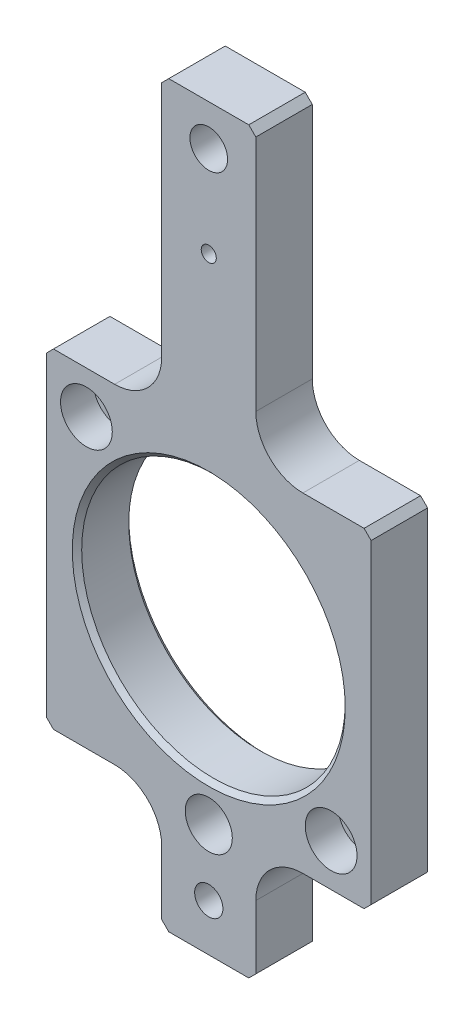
ISO-10303-21;
HEADER;
FILE_DESCRIPTION(('STEP AP214'),'2;1');
FILE_NAME('part.step','',(''),(''),'','','');
FILE_SCHEMA(('AUTOMOTIVE_DESIGN { 1 0 10303 214 1 1 1 1 }'));
ENDSEC;
DATA;
#1=APPLICATION_CONTEXT('core data for automotive mechanical design processes');
#2=APPLICATION_PROTOCOL_DEFINITION('international standard','automotive_design',2000,#1);
#3=PRODUCT_CONTEXT('',#1,'mechanical');
#4=PRODUCT('Part','Part','',(#3));
#5=PRODUCT_RELATED_PRODUCT_CATEGORY('part','',(#4));
#6=PRODUCT_DEFINITION_FORMATION('','',#4);
#7=PRODUCT_DEFINITION_CONTEXT('part definition',#1,'design');
#8=PRODUCT_DEFINITION('design','',#6,#7);
#9=PRODUCT_DEFINITION_SHAPE('','',#8);
#10=(LENGTH_UNIT() NAMED_UNIT(*) SI_UNIT(.MILLI.,.METRE.));
#11=(NAMED_UNIT(*) PLANE_ANGLE_UNIT() SI_UNIT($,.RADIAN.));
#12=(NAMED_UNIT(*) SI_UNIT($,.STERADIAN.) SOLID_ANGLE_UNIT());
#13=UNCERTAINTY_MEASURE_WITH_UNIT(LENGTH_MEASURE(1.E-05),#10,'distance_accuracy_value','');
#14=(GEOMETRIC_REPRESENTATION_CONTEXT(3) GLOBAL_UNCERTAINTY_ASSIGNED_CONTEXT((#13)) GLOBAL_UNIT_ASSIGNED_CONTEXT((#10,
#11,#12)) REPRESENTATION_CONTEXT('',''));
#15=CARTESIAN_POINT('',(0.,0.,0.));
#16=DIRECTION('',(0.,0.,1.));
#17=DIRECTION('',(1.,0.,0.));
#18=AXIS2_PLACEMENT_3D('',#15,#16,#17);
#19=CARTESIAN_POINT('',(36.,34.,0.));
#20=DIRECTION('',(0.,0.,1.));
#21=DIRECTION('',(1.,0.,0.));
#22=AXIS2_PLACEMENT_3D('',#19,#20,#21);
#23=CYLINDRICAL_SURFACE('',#22,3.2);
#24=CARTESIAN_POINT('',(36.,34.,0.));
#25=DIRECTION('',(0.,0.,1.));
#26=DIRECTION('',(1.,0.,0.));
#27=AXIS2_PLACEMENT_3D('',#24,#25,#26);
#28=CIRCLE('',#27,3.2);
#29=CARTESIAN_POINT('',(39.2,34.,0.));
#30=VERTEX_POINT('',#29);
#31=EDGE_CURVE('E348',#30,#30,#28,.T.);
#32=ORIENTED_EDGE('',*,*,#31,.F.);
#33=EDGE_LOOP('',(#32));
#34=FACE_BOUND('',#33,.T.);
#35=CARTESIAN_POINT('',(36.,34.,5.));
#36=DIRECTION('',(0.,0.,1.));
#37=DIRECTION('',(1.,0.,0.));
#38=AXIS2_PLACEMENT_3D('',#35,#36,#37);
#39=CIRCLE('',#38,3.2);
#40=CARTESIAN_POINT('',(39.2,34.,5.));
#41=VERTEX_POINT('',#40);
#42=EDGE_CURVE('E345',#41,#41,#39,.F.);
#43=ORIENTED_EDGE('',*,*,#42,.F.);
#44=EDGE_LOOP('',(#43));
#45=FACE_BOUND('',#44,.T.);
#46=ADVANCED_FACE('F40',(#34,#45),#23,.F.);
#47=CARTESIAN_POINT('',(-16.,86.,0.));
#48=DIRECTION('',(0.,0.,1.));
#49=DIRECTION('',(1.,0.,0.));
#50=AXIS2_PLACEMENT_3D('',#47,#48,#49);
#51=CYLINDRICAL_SURFACE('',#50,3.2);
#52=CARTESIAN_POINT('',(-16.,86.,0.));
#53=DIRECTION('',(0.,0.,1.));
#54=DIRECTION('',(1.,0.,0.));
#55=AXIS2_PLACEMENT_3D('',#52,#53,#54);
#56=CIRCLE('',#55,3.2);
#57=CARTESIAN_POINT('',(-12.8,86.,0.));
#58=VERTEX_POINT('',#57);
#59=EDGE_CURVE('E343',#58,#58,#56,.T.);
#60=ORIENTED_EDGE('',*,*,#59,.F.);
#61=EDGE_LOOP('',(#60));
#62=FACE_BOUND('',#61,.T.);
#63=CARTESIAN_POINT('',(-16.,86.,5.));
#64=DIRECTION('',(0.,0.,1.));
#65=DIRECTION('',(1.,0.,0.));
#66=AXIS2_PLACEMENT_3D('',#63,#64,#65);
#67=CIRCLE('',#66,3.2);
#68=CARTESIAN_POINT('',(-12.8,86.,5.));
#69=VERTEX_POINT('',#68);
#70=EDGE_CURVE('E340',#69,#69,#67,.F.);
#71=ORIENTED_EDGE('',*,*,#70,.F.);
#72=EDGE_LOOP('',(#71));
#73=FACE_BOUND('',#72,.T.);
#74=ADVANCED_FACE('F542',(#62,#73),#51,.F.);
#75=CARTESIAN_POINT('',(0.,14.9999999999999,12.));
#76=DIRECTION('',(1.,0.,0.));
#77=DIRECTION('',(0.,1.,0.));
#78=AXIS2_PLACEMENT_3D('',#75,#76,#77);
#79=PLANE('',#78);
#80=DIRECTION('',(0.,-1.,0.));
#81=VECTOR('',#80,1.);
#82=CARTESIAN_POINT('',(0.,14.9999999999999,0.));
#83=LINE('',#82,#81);
#84=CARTESIAN_POINT('',(0.,14.9999999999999,0.));
#85=VERTEX_POINT('',#84);
#86=CARTESIAN_POINT('',(0.,1.50000000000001,0.));
#87=VERTEX_POINT('',#86);
#88=EDGE_CURVE('E480',#85,#87,#83,.T.);
#89=ORIENTED_EDGE('',*,*,#88,.T.);
#90=DIRECTION('',(0.,0.,1.));
#91=VECTOR('',#90,1.);
#92=CARTESIAN_POINT('',(0.,1.50000000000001,12.));
#93=LINE('',#92,#91);
#94=CARTESIAN_POINT('',(0.,1.5,12.));
#95=VERTEX_POINT('',#94);
#96=EDGE_CURVE('E393',#87,#95,#93,.T.);
#97=ORIENTED_EDGE('',*,*,#96,.T.);
#98=DIRECTION('',(0.,-1.,0.));
#99=VECTOR('',#98,1.);
#100=CARTESIAN_POINT('',(0.,14.9999999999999,12.));
#101=LINE('',#100,#99);
#102=CARTESIAN_POINT('',(0.,14.9999999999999,12.));
#103=VERTEX_POINT('',#102);
#104=EDGE_CURVE('E269',#103,#95,#101,.T.);
#105=ORIENTED_EDGE('',*,*,#104,.F.);
#106=DIRECTION('',(0.,0.,-1.));
#107=VECTOR('',#106,1.);
#108=CARTESIAN_POINT('',(0.,14.9999999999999,12.));
#109=LINE('',#108,#107);
#110=EDGE_CURVE('E312',#103,#85,#109,.T.);
#111=ORIENTED_EDGE('',*,*,#110,.T.);
#112=EDGE_LOOP('',(#89,#97,#105,#111));
#113=FACE_BOUND('',#112,.T.);
#114=ADVANCED_FACE('F42',(#113),#79,.F.);
#115=CARTESIAN_POINT('',(0.,0.,12.));
#116=DIRECTION('',(0.,1.,0.));
#117=DIRECTION('',(0.,0.,1.));
#118=AXIS2_PLACEMENT_3D('',#115,#116,#117);
#119=PLANE('',#118);
#120=CARTESIAN_POINT('',(10.,0.,6.));
#121=DIRECTION('',(0.,-1.,0.));
#122=DIRECTION('',(0.,0.,-1.));
#123=AXIS2_PLACEMENT_3D('',#120,#121,#122);
#124=CIRCLE('',#123,1.6);
#125=CARTESIAN_POINT('',(10.,0.,4.4));
#126=VERTEX_POINT('',#125);
#127=EDGE_CURVE('E522',#126,#126,#124,.T.);
#128=ORIENTED_EDGE('',*,*,#127,.F.);
#129=EDGE_LOOP('',(#128));
#130=FACE_BOUND('',#129,.T.);
#131=DIRECTION('',(1.,0.,0.));
#132=VECTOR('',#131,1.);
#133=CARTESIAN_POINT('',(0.,0.,0.));
#134=LINE('',#133,#132);
#135=CARTESIAN_POINT('',(1.50000000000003,0.,0.));
#136=VERTEX_POINT('',#135);
#137=CARTESIAN_POINT('',(18.5,0.,0.));
#138=VERTEX_POINT('',#137);
#139=EDGE_CURVE('E220',#136,#138,#134,.T.);
#140=ORIENTED_EDGE('',*,*,#139,.T.);
#141=DIRECTION('',(0.,0.,1.));
#142=VECTOR('',#141,1.);
#143=CARTESIAN_POINT('',(18.5,0.,12.));
#144=LINE('',#143,#142);
#145=CARTESIAN_POINT('',(18.5,0.,12.));
#146=VERTEX_POINT('',#145);
#147=EDGE_CURVE('E391',#138,#146,#144,.T.);
#148=ORIENTED_EDGE('',*,*,#147,.T.);
#149=DIRECTION('',(1.,0.,0.));
#150=VECTOR('',#149,1.);
#151=CARTESIAN_POINT('',(0.,0.,12.));
#152=LINE('',#151,#150);
#153=CARTESIAN_POINT('',(1.50000000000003,0.,12.));
#154=VERTEX_POINT('',#153);
#155=EDGE_CURVE('E272',#154,#146,#152,.T.);
#156=ORIENTED_EDGE('',*,*,#155,.F.);
#157=DIRECTION('',(0.,0.,-1.));
#158=VECTOR('',#157,1.);
#159=CARTESIAN_POINT('',(1.50000000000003,0.,12.));
#160=LINE('',#159,#158);
#161=EDGE_CURVE('E388',#154,#136,#160,.T.);
#162=ORIENTED_EDGE('',*,*,#161,.T.);
#163=EDGE_LOOP('',(#140,#148,#156,#162));
#164=FACE_BOUND('',#163,.T.);
#165=ADVANCED_FACE('F477',(#130,#164),#119,.F.);
#166=CARTESIAN_POINT('',(20.,0.,12.));
#167=DIRECTION('',(-1.,0.,0.));
#168=DIRECTION('',(0.,0.,1.));
#169=AXIS2_PLACEMENT_3D('',#166,#167,#168);
#170=PLANE('',#169);
#171=DIRECTION('',(0.,1.,0.));
#172=VECTOR('',#171,1.);
#173=CARTESIAN_POINT('',(20.,0.,12.));
#174=LINE('',#173,#172);
#175=CARTESIAN_POINT('',(20.,1.50000000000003,12.));
#176=VERTEX_POINT('',#175);
#177=CARTESIAN_POINT('',(20.,15.,12.));
#178=VERTEX_POINT('',#177);
#179=EDGE_CURVE('E275',#176,#178,#174,.T.);
#180=ORIENTED_EDGE('',*,*,#179,.F.);
#181=DIRECTION('',(0.,0.,-1.));
#182=VECTOR('',#181,1.);
#183=CARTESIAN_POINT('',(20.,1.50000000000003,12.));
#184=LINE('',#183,#182);
#185=CARTESIAN_POINT('',(20.,1.50000000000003,0.));
#186=VERTEX_POINT('',#185);
#187=EDGE_CURVE('E216',#176,#186,#184,.T.);
#188=ORIENTED_EDGE('',*,*,#187,.T.);
#189=DIRECTION('',(0.,1.,0.));
#190=VECTOR('',#189,1.);
#191=CARTESIAN_POINT('',(20.,0.,0.));
#192=LINE('',#191,#190);
#193=CARTESIAN_POINT('',(20.,15.,0.));
#194=VERTEX_POINT('',#193);
#195=EDGE_CURVE('E209',#186,#194,#192,.T.);
#196=ORIENTED_EDGE('',*,*,#195,.T.);
#197=DIRECTION('',(0.,0.,-1.));
#198=VECTOR('',#197,1.);
#199=CARTESIAN_POINT('',(20.,15.,12.));
#200=LINE('',#199,#198);
#201=EDGE_CURVE('E213',#178,#194,#200,.T.);
#202=ORIENTED_EDGE('',*,*,#201,.F.);
#203=EDGE_LOOP('',(#180,#188,#196,#202));
#204=FACE_BOUND('',#203,.T.);
#205=ADVANCED_FACE('F212',(#204),#170,.F.);
#206=CARTESIAN_POINT('',(30.,15.,12.));
#207=DIRECTION('',(0.,0.,-1.));
#208=DIRECTION('',(-1.,0.,0.));
#209=AXIS2_PLACEMENT_3D('',#206,#207,#208);
#210=CYLINDRICAL_SURFACE('',#209,10.);
#211=CARTESIAN_POINT('',(30.,15.,0.));
#212=DIRECTION('',(0.,0.,1.));
#213=DIRECTION('',(1.,0.,0.));
#214=AXIS2_PLACEMENT_3D('',#211,#212,#213);
#215=CIRCLE('',#214,10.);
#216=CARTESIAN_POINT('',(30.,25.,0.));
#217=VERTEX_POINT('',#216);
#218=EDGE_CURVE('E219',#217,#194,#215,.T.);
#219=ORIENTED_EDGE('',*,*,#218,.F.);
#220=DIRECTION('',(0.,0.,-1.));
#221=VECTOR('',#220,1.);
#222=CARTESIAN_POINT('',(30.,25.,12.));
#223=LINE('',#222,#221);
#224=CARTESIAN_POINT('',(30.,25.,12.));
#225=VERTEX_POINT('',#224);
#226=EDGE_CURVE('E228',#225,#217,#223,.T.);
#227=ORIENTED_EDGE('',*,*,#226,.F.);
#228=CARTESIAN_POINT('',(30.,15.,12.));
#229=DIRECTION('',(0.,0.,1.));
#230=DIRECTION('',(1.,0.,0.));
#231=AXIS2_PLACEMENT_3D('',#228,#229,#230);
#232=CIRCLE('',#231,10.);
#233=EDGE_CURVE('E226',#225,#178,#232,.T.);
#234=ORIENTED_EDGE('',*,*,#233,.T.);
#235=ORIENTED_EDGE('',*,*,#201,.T.);
#236=EDGE_LOOP('',(#219,#227,#234,#235));
#237=FACE_BOUND('',#236,.T.);
#238=ADVANCED_FACE('F224',(#237),#210,.F.);
#239=CARTESIAN_POINT('',(30.,25.,12.));
#240=DIRECTION('',(0.,1.,0.));
#241=DIRECTION('',(0.,0.,1.));
#242=AXIS2_PLACEMENT_3D('',#239,#240,#241);
#243=PLANE('',#242);
#244=DIRECTION('',(1.,0.,0.));
#245=VECTOR('',#244,1.);
#246=CARTESIAN_POINT('',(30.,25.,0.));
#247=LINE('',#246,#245);
#248=CARTESIAN_POINT('',(43.,25.,0.));
#249=VERTEX_POINT('',#248);
#250=EDGE_CURVE('E234',#217,#249,#247,.T.);
#251=ORIENTED_EDGE('',*,*,#250,.T.);
#252=DIRECTION('',(0.,0.,1.));
#253=VECTOR('',#252,1.);
#254=CARTESIAN_POINT('',(43.,25.,12.));
#255=LINE('',#254,#253);
#256=CARTESIAN_POINT('',(43.,25.,12.));
#257=VERTEX_POINT('',#256);
#258=EDGE_CURVE('E370',#249,#257,#255,.T.);
#259=ORIENTED_EDGE('',*,*,#258,.T.);
#260=DIRECTION('',(1.,0.,0.));
#261=VECTOR('',#260,1.);
#262=CARTESIAN_POINT('',(30.,25.,12.));
#263=LINE('',#262,#261);
#264=EDGE_CURVE('E278',#225,#257,#263,.T.);
#265=ORIENTED_EDGE('',*,*,#264,.F.);
#266=ORIENTED_EDGE('',*,*,#226,.T.);
#267=EDGE_LOOP('',(#251,#259,#265,#266));
#268=FACE_BOUND('',#267,.T.);
#269=ADVANCED_FACE('F469',(#268),#243,.F.);
#270=CARTESIAN_POINT('',(44.5,25.,12.));
#271=DIRECTION('',(-1.,0.,0.));
#272=DIRECTION('',(0.,0.,1.));
#273=AXIS2_PLACEMENT_3D('',#270,#271,#272);
#274=PLANE('',#273);
#275=DIRECTION('',(0.,1.,0.));
#276=VECTOR('',#275,1.);
#277=CARTESIAN_POINT('',(44.5,25.,12.));
#278=LINE('',#277,#276);
#279=CARTESIAN_POINT('',(44.5,26.5,12.));
#280=VERTEX_POINT('',#279);
#281=CARTESIAN_POINT('',(44.5,93.5,12.));
#282=VERTEX_POINT('',#281);
#283=EDGE_CURVE('E281',#280,#282,#278,.T.);
#284=ORIENTED_EDGE('',*,*,#283,.F.);
#285=DIRECTION('',(0.,0.,-1.));
#286=VECTOR('',#285,1.);
#287=CARTESIAN_POINT('',(44.5,26.5,12.));
#288=LINE('',#287,#286);
#289=CARTESIAN_POINT('',(44.5,26.5,0.));
#290=VERTEX_POINT('',#289);
#291=EDGE_CURVE('E351',#280,#290,#288,.T.);
#292=ORIENTED_EDGE('',*,*,#291,.T.);
#293=DIRECTION('',(0.,1.,0.));
#294=VECTOR('',#293,1.);
#295=CARTESIAN_POINT('',(44.5,25.,0.));
#296=LINE('',#295,#294);
#297=CARTESIAN_POINT('',(44.5,93.5,0.));
#298=VERTEX_POINT('',#297);
#299=EDGE_CURVE('E236',#290,#298,#296,.T.);
#300=ORIENTED_EDGE('',*,*,#299,.T.);
#301=DIRECTION('',(0.,0.,1.));
#302=VECTOR('',#301,1.);
#303=CARTESIAN_POINT('',(44.5,93.5,12.));
#304=LINE('',#303,#302);
#305=EDGE_CURVE('E339',#298,#282,#304,.T.);
#306=ORIENTED_EDGE('',*,*,#305,.T.);
#307=EDGE_LOOP('',(#284,#292,#300,#306));
#308=FACE_BOUND('',#307,.T.);
#309=ADVANCED_FACE('F461',(#308),#274,.F.);
#310=CARTESIAN_POINT('',(44.5,95.,12.));
#311=DIRECTION('',(0.,-1.,0.));
#312=DIRECTION('',(0.,0.,-1.));
#313=AXIS2_PLACEMENT_3D('',#310,#311,#312);
#314=PLANE('',#313);
#315=DIRECTION('',(-1.,0.,0.));
#316=VECTOR('',#315,1.);
#317=CARTESIAN_POINT('',(44.5,95.,12.));
#318=LINE('',#317,#316);
#319=CARTESIAN_POINT('',(43.,95.,12.));
#320=VERTEX_POINT('',#319);
#321=CARTESIAN_POINT('',(30.,95.,12.));
#322=VERTEX_POINT('',#321);
#323=EDGE_CURVE('E284',#320,#322,#318,.T.);
#324=ORIENTED_EDGE('',*,*,#323,.F.);
#325=DIRECTION('',(0.,0.,-1.));
#326=VECTOR('',#325,1.);
#327=CARTESIAN_POINT('',(43.,95.,12.));
#328=LINE('',#327,#326);
#329=CARTESIAN_POINT('',(43.,95.,0.));
#330=VERTEX_POINT('',#329);
#331=EDGE_CURVE('E402',#320,#330,#328,.T.);
#332=ORIENTED_EDGE('',*,*,#331,.T.);
#333=DIRECTION('',(-1.,0.,0.));
#334=VECTOR('',#333,1.);
#335=CARTESIAN_POINT('',(44.5,95.,0.));
#336=LINE('',#335,#334);
#337=CARTESIAN_POINT('',(30.,95.,0.));
#338=VERTEX_POINT('',#337);
#339=EDGE_CURVE('E242',#330,#338,#336,.T.);
#340=ORIENTED_EDGE('',*,*,#339,.T.);
#341=DIRECTION('',(0.,0.,-1.));
#342=VECTOR('',#341,1.);
#343=CARTESIAN_POINT('',(30.,95.,12.));
#344=LINE('',#343,#342);
#345=EDGE_CURVE('E324',#322,#338,#344,.T.);
#346=ORIENTED_EDGE('',*,*,#345,.F.);
#347=EDGE_LOOP('',(#324,#332,#340,#346));
#348=FACE_BOUND('',#347,.T.);
#349=ADVANCED_FACE('F453',(#348),#314,.F.);
#350=CARTESIAN_POINT('',(30.,105.,12.));
#351=DIRECTION('',(0.,0.,-1.));
#352=DIRECTION('',(-1.,0.,0.));
#353=AXIS2_PLACEMENT_3D('',#350,#351,#352);
#354=CYLINDRICAL_SURFACE('',#353,10.);
#355=CARTESIAN_POINT('',(30.,105.,0.));
#356=DIRECTION('',(0.,0.,1.));
#357=DIRECTION('',(1.,0.,0.));
#358=AXIS2_PLACEMENT_3D('',#355,#356,#357);
#359=CIRCLE('',#358,10.);
#360=CARTESIAN_POINT('',(20.,105.,0.));
#361=VERTEX_POINT('',#360);
#362=EDGE_CURVE('E244',#361,#338,#359,.T.);
#363=ORIENTED_EDGE('',*,*,#362,.F.);
#364=DIRECTION('',(0.,0.,-1.));
#365=VECTOR('',#364,1.);
#366=CARTESIAN_POINT('',(20.,105.,12.));
#367=LINE('',#366,#365);
#368=CARTESIAN_POINT('',(20.,105.,12.));
#369=VERTEX_POINT('',#368);
#370=EDGE_CURVE('E322',#369,#361,#367,.T.);
#371=ORIENTED_EDGE('',*,*,#370,.F.);
#372=CARTESIAN_POINT('',(30.,105.,12.));
#373=DIRECTION('',(0.,0.,1.));
#374=DIRECTION('',(1.,0.,0.));
#375=AXIS2_PLACEMENT_3D('',#372,#373,#374);
#376=CIRCLE('',#375,10.);
#377=EDGE_CURVE('E286',#369,#322,#376,.T.);
#378=ORIENTED_EDGE('',*,*,#377,.T.);
#379=ORIENTED_EDGE('',*,*,#345,.T.);
#380=EDGE_LOOP('',(#363,#371,#378,#379));
#381=FACE_BOUND('',#380,.T.);
#382=ADVANCED_FACE('F450',(#381),#354,.F.);
#383=CARTESIAN_POINT('',(20.,105.,12.));
#384=DIRECTION('',(-1.,0.,0.));
#385=DIRECTION('',(0.,0.,1.));
#386=AXIS2_PLACEMENT_3D('',#383,#384,#385);
#387=PLANE('',#386);
#388=DIRECTION('',(0.,1.,0.));
#389=VECTOR('',#388,1.);
#390=CARTESIAN_POINT('',(20.,105.,0.));
#391=LINE('',#390,#389);
#392=CARTESIAN_POINT('',(20.,155.5,0.));
#393=VERTEX_POINT('',#392);
#394=EDGE_CURVE('E247',#361,#393,#391,.T.);
#395=ORIENTED_EDGE('',*,*,#394,.T.);
#396=DIRECTION('',(0.,0.,1.));
#397=VECTOR('',#396,1.);
#398=CARTESIAN_POINT('',(20.,155.5,12.));
#399=LINE('',#398,#397);
#400=CARTESIAN_POINT('',(20.,155.5,12.));
#401=VERTEX_POINT('',#400);
#402=EDGE_CURVE('E410',#393,#401,#399,.T.);
#403=ORIENTED_EDGE('',*,*,#402,.T.);
#404=DIRECTION('',(0.,1.,0.));
#405=VECTOR('',#404,1.);
#406=CARTESIAN_POINT('',(20.,105.,12.));
#407=LINE('',#406,#405);
#408=EDGE_CURVE('E289',#369,#401,#407,.T.);
#409=ORIENTED_EDGE('',*,*,#408,.F.);
#410=ORIENTED_EDGE('',*,*,#370,.T.);
#411=EDGE_LOOP('',(#395,#403,#409,#410));
#412=FACE_BOUND('',#411,.T.);
#413=ADVANCED_FACE('F442',(#412),#387,.F.);
#414=CARTESIAN_POINT('',(20.,157.,12.));
#415=DIRECTION('',(0.,-1.,0.));
#416=DIRECTION('',(1.,0.,0.));
#417=AXIS2_PLACEMENT_3D('',#414,#415,#416);
#418=PLANE('',#417);
#419=DIRECTION('',(-1.,0.,0.));
#420=VECTOR('',#419,1.);
#421=CARTESIAN_POINT('',(20.,157.,12.));
#422=LINE('',#421,#420);
#423=CARTESIAN_POINT('',(18.5,157.,12.));
#424=VERTEX_POINT('',#423);
#425=CARTESIAN_POINT('',(1.50000000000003,157.,12.));
#426=VERTEX_POINT('',#425);
#427=EDGE_CURVE('E293',#424,#426,#422,.T.);
#428=ORIENTED_EDGE('',*,*,#427,.F.);
#429=DIRECTION('',(0.,0.,-1.));
#430=VECTOR('',#429,1.);
#431=CARTESIAN_POINT('',(18.5,157.,12.));
#432=LINE('',#431,#430);
#433=CARTESIAN_POINT('',(18.5,157.,0.));
#434=VERTEX_POINT('',#433);
#435=EDGE_CURVE('E407',#424,#434,#432,.T.);
#436=ORIENTED_EDGE('',*,*,#435,.T.);
#437=DIRECTION('',(-1.,0.,0.));
#438=VECTOR('',#437,1.);
#439=CARTESIAN_POINT('',(20.,157.,0.));
#440=LINE('',#439,#438);
#441=CARTESIAN_POINT('',(1.50000000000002,157.,0.));
#442=VERTEX_POINT('',#441);
#443=EDGE_CURVE('E251',#434,#442,#440,.T.);
#444=ORIENTED_EDGE('',*,*,#443,.T.);
#445=DIRECTION('',(0.,0.,1.));
#446=VECTOR('',#445,1.);
#447=CARTESIAN_POINT('',(1.50000000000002,157.,12.));
#448=LINE('',#447,#446);
#449=EDGE_CURVE('E405',#442,#426,#448,.T.);
#450=ORIENTED_EDGE('',*,*,#449,.T.);
#451=EDGE_LOOP('',(#428,#436,#444,#450));
#452=FACE_BOUND('',#451,.T.);
#453=ADVANCED_FACE('F435',(#452),#418,.F.);
#454=CARTESIAN_POINT('',(0.,157.,12.));
#455=DIRECTION('',(1.,0.,0.));
#456=DIRECTION('',(0.,0.,-1.));
#457=AXIS2_PLACEMENT_3D('',#454,#455,#456);
#458=PLANE('',#457);
#459=DIRECTION('',(0.,-1.,0.));
#460=VECTOR('',#459,1.);
#461=CARTESIAN_POINT('',(0.,157.,12.));
#462=LINE('',#461,#460);
#463=CARTESIAN_POINT('',(0.,155.5,12.));
#464=VERTEX_POINT('',#463);
#465=CARTESIAN_POINT('',(0.,105.,12.));
#466=VERTEX_POINT('',#465);
#467=EDGE_CURVE('E296',#464,#466,#462,.T.);
#468=ORIENTED_EDGE('',*,*,#467,.F.);
#469=DIRECTION('',(0.,0.,-1.));
#470=VECTOR('',#469,1.);
#471=CARTESIAN_POINT('',(0.,155.5,12.));
#472=LINE('',#471,#470);
#473=CARTESIAN_POINT('',(0.,155.5,0.));
#474=VERTEX_POINT('',#473);
#475=EDGE_CURVE('E54',#464,#474,#472,.T.);
#476=ORIENTED_EDGE('',*,*,#475,.T.);
#477=DIRECTION('',(0.,-1.,0.));
#478=VECTOR('',#477,1.);
#479=CARTESIAN_POINT('',(0.,157.,0.));
#480=LINE('',#479,#478);
#481=CARTESIAN_POINT('',(0.,105.,0.));
#482=VERTEX_POINT('',#481);
#483=EDGE_CURVE('E254',#474,#482,#480,.T.);
#484=ORIENTED_EDGE('',*,*,#483,.T.);
#485=DIRECTION('',(0.,0.,-1.));
#486=VECTOR('',#485,1.);
#487=CARTESIAN_POINT('',(0.,105.,12.));
#488=LINE('',#487,#486);
#489=EDGE_CURVE('E319',#466,#482,#488,.T.);
#490=ORIENTED_EDGE('',*,*,#489,.F.);
#491=EDGE_LOOP('',(#468,#476,#484,#490));
#492=FACE_BOUND('',#491,.T.);
#493=ADVANCED_FACE('F418',(#492),#458,.F.);
#494=CARTESIAN_POINT('',(-9.99999999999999,105.,12.));
#495=DIRECTION('',(0.,0.,-1.));
#496=DIRECTION('',(-1.,0.,0.));
#497=AXIS2_PLACEMENT_3D('',#494,#495,#496);
#498=CYLINDRICAL_SURFACE('',#497,10.);
#499=CARTESIAN_POINT('',(-9.99999999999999,105.,0.));
#500=DIRECTION('',(0.,0.,1.));
#501=DIRECTION('',(1.,0.,0.));
#502=AXIS2_PLACEMENT_3D('',#499,#500,#501);
#503=CIRCLE('',#502,10.);
#504=CARTESIAN_POINT('',(-10.,95.,0.));
#505=VERTEX_POINT('',#504);
#506=EDGE_CURVE('E256',#505,#482,#503,.T.);
#507=ORIENTED_EDGE('',*,*,#506,.F.);
#508=DIRECTION('',(0.,0.,-1.));
#509=VECTOR('',#508,1.);
#510=CARTESIAN_POINT('',(-10.,95.,12.));
#511=LINE('',#510,#509);
#512=CARTESIAN_POINT('',(-10.,95.,12.));
#513=VERTEX_POINT('',#512);
#514=EDGE_CURVE('E317',#513,#505,#511,.T.);
#515=ORIENTED_EDGE('',*,*,#514,.F.);
#516=CARTESIAN_POINT('',(-9.99999999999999,105.,12.));
#517=DIRECTION('',(0.,0.,1.));
#518=DIRECTION('',(1.,0.,0.));
#519=AXIS2_PLACEMENT_3D('',#516,#517,#518);
#520=CIRCLE('',#519,10.);
#521=EDGE_CURVE('E299',#513,#466,#520,.T.);
#522=ORIENTED_EDGE('',*,*,#521,.T.);
#523=ORIENTED_EDGE('',*,*,#489,.T.);
#524=EDGE_LOOP('',(#507,#515,#522,#523));
#525=FACE_BOUND('',#524,.T.);
#526=ADVANCED_FACE('F426',(#525),#498,.F.);
#527=CARTESIAN_POINT('',(-9.99999999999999,95.,12.));
#528=DIRECTION('',(0.,-1.,0.));
#529=DIRECTION('',(0.,0.,-1.));
#530=AXIS2_PLACEMENT_3D('',#527,#528,#529);
#531=PLANE('',#530);
#532=DIRECTION('',(-1.,0.,0.));
#533=VECTOR('',#532,1.);
#534=CARTESIAN_POINT('',(-9.99999999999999,95.,0.));
#535=LINE('',#534,#533);
#536=CARTESIAN_POINT('',(-23.,95.,0.));
#537=VERTEX_POINT('',#536);
#538=EDGE_CURVE('E259',#505,#537,#535,.T.);
#539=ORIENTED_EDGE('',*,*,#538,.T.);
#540=DIRECTION('',(0.,0.,1.));
#541=VECTOR('',#540,1.);
#542=CARTESIAN_POINT('',(-23.,95.,12.));
#543=LINE('',#542,#541);
#544=CARTESIAN_POINT('',(-23.,95.,12.));
#545=VERTEX_POINT('',#544);
#546=EDGE_CURVE('E11',#537,#545,#543,.T.);
#547=ORIENTED_EDGE('',*,*,#546,.T.);
#548=DIRECTION('',(-1.,0.,0.));
#549=VECTOR('',#548,1.);
#550=CARTESIAN_POINT('',(-9.99999999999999,95.,12.));
#551=LINE('',#550,#549);
#552=EDGE_CURVE('E302',#513,#545,#551,.T.);
#553=ORIENTED_EDGE('',*,*,#552,.F.);
#554=ORIENTED_EDGE('',*,*,#514,.T.);
#555=EDGE_LOOP('',(#539,#547,#553,#554));
#556=FACE_BOUND('',#555,.T.);
#557=ADVANCED_FACE('F594',(#556),#531,.F.);
#558=CARTESIAN_POINT('',(-24.5,95.,12.));
#559=DIRECTION('',(1.,0.,0.));
#560=DIRECTION('',(0.,1.,0.));
#561=AXIS2_PLACEMENT_3D('',#558,#559,#560);
#562=PLANE('',#561);
#563=DIRECTION('',(0.,-1.,0.));
#564=VECTOR('',#563,1.);
#565=CARTESIAN_POINT('',(-24.5,95.,0.));
#566=LINE('',#565,#564);
#567=CARTESIAN_POINT('',(-24.5,93.4999999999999,0.));
#568=VERTEX_POINT('',#567);
#569=CARTESIAN_POINT('',(-24.5,26.5,0.));
#570=VERTEX_POINT('',#569);
#571=EDGE_CURVE('E262',#568,#570,#566,.T.);
#572=ORIENTED_EDGE('',*,*,#571,.T.);
#573=DIRECTION('',(0.,0.,1.));
#574=VECTOR('',#573,1.);
#575=CARTESIAN_POINT('',(-24.5,26.5,12.));
#576=LINE('',#575,#574);
#577=CARTESIAN_POINT('',(-24.5,26.5,12.));
#578=VERTEX_POINT('',#577);
#579=EDGE_CURVE('E69',#570,#578,#576,.T.);
#580=ORIENTED_EDGE('',*,*,#579,.T.);
#581=DIRECTION('',(0.,-1.,0.));
#582=VECTOR('',#581,1.);
#583=CARTESIAN_POINT('',(-24.5,95.,12.));
#584=LINE('',#583,#582);
#585=CARTESIAN_POINT('',(-24.5,93.4999999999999,12.));
#586=VERTEX_POINT('',#585);
#587=EDGE_CURVE('E305',#586,#578,#584,.T.);
#588=ORIENTED_EDGE('',*,*,#587,.F.);
#589=DIRECTION('',(0.,0.,-1.));
#590=VECTOR('',#589,1.);
#591=CARTESIAN_POINT('',(-24.5,93.4999999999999,12.));
#592=LINE('',#591,#590);
#593=EDGE_CURVE('E398',#586,#568,#592,.T.);
#594=ORIENTED_EDGE('',*,*,#593,.T.);
#595=EDGE_LOOP('',(#572,#580,#588,#594));
#596=FACE_BOUND('',#595,.T.);
#597=ADVANCED_FACE('F590',(#596),#562,.F.);
#598=CARTESIAN_POINT('',(-24.5,25.,12.));
#599=DIRECTION('',(0.,1.,0.));
#600=DIRECTION('',(0.,0.,1.));
#601=AXIS2_PLACEMENT_3D('',#598,#599,#600);
#602=PLANE('',#601);
#603=DIRECTION('',(1.,0.,0.));
#604=VECTOR('',#603,1.);
#605=CARTESIAN_POINT('',(-24.5,25.,12.));
#606=LINE('',#605,#604);
#607=CARTESIAN_POINT('',(-23.,25.,12.));
#608=VERTEX_POINT('',#607);
#609=CARTESIAN_POINT('',(-10.0000000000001,25.,12.));
#610=VERTEX_POINT('',#609);
#611=EDGE_CURVE('E307',#608,#610,#606,.T.);
#612=ORIENTED_EDGE('',*,*,#611,.F.);
#613=DIRECTION('',(0.,0.,-1.));
#614=VECTOR('',#613,1.);
#615=CARTESIAN_POINT('',(-23.,25.,12.));
#616=LINE('',#615,#614);
#617=CARTESIAN_POINT('',(-23.,25.,0.));
#618=VERTEX_POINT('',#617);
#619=EDGE_CURVE('E395',#608,#618,#616,.T.);
#620=ORIENTED_EDGE('',*,*,#619,.T.);
#621=DIRECTION('',(1.,0.,0.));
#622=VECTOR('',#621,1.);
#623=CARTESIAN_POINT('',(-24.5,25.,0.));
#624=LINE('',#623,#622);
#625=CARTESIAN_POINT('',(-10.0000000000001,25.,0.));
#626=VERTEX_POINT('',#625);
#627=EDGE_CURVE('E264',#618,#626,#624,.T.);
#628=ORIENTED_EDGE('',*,*,#627,.T.);
#629=DIRECTION('',(0.,0.,-1.));
#630=VECTOR('',#629,1.);
#631=CARTESIAN_POINT('',(-10.0000000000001,25.,12.));
#632=LINE('',#631,#630);
#633=EDGE_CURVE('E314',#610,#626,#632,.T.);
#634=ORIENTED_EDGE('',*,*,#633,.F.);
#635=EDGE_LOOP('',(#612,#620,#628,#634));
#636=FACE_BOUND('',#635,.T.);
#637=ADVANCED_FACE('F586',(#636),#602,.F.);
#638=CARTESIAN_POINT('',(-10.,15.,12.));
#639=DIRECTION('',(0.,0.,-1.));
#640=DIRECTION('',(-1.,0.,0.));
#641=AXIS2_PLACEMENT_3D('',#638,#639,#640);
#642=CYLINDRICAL_SURFACE('',#641,10.);
#643=CARTESIAN_POINT('',(-10.,15.,0.));
#644=DIRECTION('',(0.,0.,1.));
#645=DIRECTION('',(1.,0.,0.));
#646=AXIS2_PLACEMENT_3D('',#643,#644,#645);
#647=CIRCLE('',#646,10.);
#648=EDGE_CURVE('E266',#85,#626,#647,.T.);
#649=ORIENTED_EDGE('',*,*,#648,.F.);
#650=ORIENTED_EDGE('',*,*,#110,.F.);
#651=CARTESIAN_POINT('',(-10.,15.,12.));
#652=DIRECTION('',(0.,0.,1.));
#653=DIRECTION('',(1.,0.,0.));
#654=AXIS2_PLACEMENT_3D('',#651,#652,#653);
#655=CIRCLE('',#654,10.);
#656=EDGE_CURVE('E309',#103,#610,#655,.T.);
#657=ORIENTED_EDGE('',*,*,#656,.T.);
#658=ORIENTED_EDGE('',*,*,#633,.T.);
#659=EDGE_LOOP('',(#649,#650,#657,#658));
#660=FACE_BOUND('',#659,.T.);
#661=ADVANCED_FACE('F582',(#660),#642,.F.);
#662=CARTESIAN_POINT('',(30.,15.,12.));
#663=DIRECTION('',(0.,0.,1.));
#664=DIRECTION('',(1.,0.,0.));
#665=AXIS2_PLACEMENT_3D('',#662,#663,#664);
#666=PLANE('',#665);
#667=CARTESIAN_POINT('',(10.,129.,12.));
#668=DIRECTION('',(0.,0.,1.));
#669=DIRECTION('',(1.,0.,0.));
#670=AXIS2_PLACEMENT_3D('',#667,#668,#669);
#671=CIRCLE('',#670,1.59999999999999);
#672=CARTESIAN_POINT('',(11.6,129.,12.));
#673=VERTEX_POINT('',#672);
#674=EDGE_CURVE('E519',#673,#673,#671,.T.);
#675=ORIENTED_EDGE('',*,*,#674,.F.);
#676=EDGE_LOOP('',(#675));
#677=FACE_BOUND('',#676,.T.);
#678=CARTESIAN_POINT('',(10.,9.99999999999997,12.));
#679=DIRECTION('',(0.,0.,1.));
#680=DIRECTION('',(1.,0.,0.));
#681=AXIS2_PLACEMENT_3D('',#678,#679,#680);
#682=CIRCLE('',#681,3.);
#683=CARTESIAN_POINT('',(13.,9.99999999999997,12.));
#684=VERTEX_POINT('',#683);
#685=EDGE_CURVE('E513',#684,#684,#682,.T.);
#686=ORIENTED_EDGE('',*,*,#685,.F.);
#687=EDGE_LOOP('',(#686));
#688=FACE_BOUND('',#687,.T.);
#689=CARTESIAN_POINT('',(10.,24.,12.));
#690=DIRECTION('',(0.,0.,1.));
#691=DIRECTION('',(1.,0.,0.));
#692=AXIS2_PLACEMENT_3D('',#689,#690,#691);
#693=CIRCLE('',#692,5.);
#694=CARTESIAN_POINT('',(15.,24.,12.));
#695=VERTEX_POINT('',#694);
#696=EDGE_CURVE('E507',#695,#695,#693,.T.);
#697=ORIENTED_EDGE('',*,*,#696,.F.);
#698=EDGE_LOOP('',(#697));
#699=FACE_BOUND('',#698,.T.);
#700=CARTESIAN_POINT('',(10.,148.37,12.));
#701=DIRECTION('',(0.,0.,1.));
#702=DIRECTION('',(1.,0.,0.));
#703=AXIS2_PLACEMENT_3D('',#700,#701,#702);
#704=CIRCLE('',#703,4.);
#705=CARTESIAN_POINT('',(14.,148.37,12.));
#706=VERTEX_POINT('',#705);
#707=EDGE_CURVE('E501',#706,#706,#704,.T.);
#708=ORIENTED_EDGE('',*,*,#707,.F.);
#709=EDGE_LOOP('',(#708));
#710=FACE_BOUND('',#709,.T.);
#711=CARTESIAN_POINT('',(36.,34.,12.));
#712=DIRECTION('',(0.,0.,1.));
#713=DIRECTION('',(1.,0.,0.));
#714=AXIS2_PLACEMENT_3D('',#711,#712,#713);
#715=CIRCLE('',#714,5.5);
#716=CARTESIAN_POINT('',(41.5,34.,12.));
#717=VERTEX_POINT('',#716);
#718=EDGE_CURVE('E495',#717,#717,#715,.T.);
#719=ORIENTED_EDGE('',*,*,#718,.F.);
#720=EDGE_LOOP('',(#719));
#721=FACE_BOUND('',#720,.T.);
#722=CARTESIAN_POINT('',(-16.,86.,12.));
#723=DIRECTION('',(0.,0.,1.));
#724=DIRECTION('',(1.,0.,0.));
#725=AXIS2_PLACEMENT_3D('',#722,#723,#724);
#726=CIRCLE('',#725,5.5);
#727=CARTESIAN_POINT('',(-10.5,86.,12.));
#728=VERTEX_POINT('',#727);
#729=EDGE_CURVE('E488',#728,#728,#726,.T.);
#730=ORIENTED_EDGE('',*,*,#729,.F.);
#731=EDGE_LOOP('',(#730));
#732=FACE_BOUND('',#731,.T.);
#733=CARTESIAN_POINT('',(10.,60.,12.));
#734=DIRECTION('',(0.,0.,1.));
#735=DIRECTION('',(1.,0.,0.));
#736=AXIS2_PLACEMENT_3D('',#733,#734,#735);
#737=CIRCLE('',#736,29.);
#738=CARTESIAN_POINT('',(39.,60.,12.));
#739=VERTEX_POINT('',#738);
#740=EDGE_CURVE('E336',#739,#739,#737,.F.);
#741=ORIENTED_EDGE('',*,*,#740,.T.);
#742=EDGE_LOOP('',(#741));
#743=FACE_BOUND('',#742,.T.);
#744=ORIENTED_EDGE('',*,*,#264,.T.);
#745=DIRECTION('',(-0.707106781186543,-0.707106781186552,0.));
#746=VECTOR('',#745,1.);
#747=CARTESIAN_POINT('',(31.5000000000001,13.4999999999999,12.));
#748=LINE('',#747,#746);
#749=EDGE_CURVE('E385',#257,#280,#748,.F.);
#750=ORIENTED_EDGE('',*,*,#749,.T.);
#751=ORIENTED_EDGE('',*,*,#283,.T.);
#752=DIRECTION('',(0.707106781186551,-0.707106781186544,0.));
#753=VECTOR('',#752,1.);
#754=CARTESIAN_POINT('',(76.4999999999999,61.5000000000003,12.));
#755=LINE('',#754,#753);
#756=EDGE_CURVE('E378',#282,#320,#755,.F.);
#757=ORIENTED_EDGE('',*,*,#756,.T.);
#758=ORIENTED_EDGE('',*,*,#323,.T.);
#759=ORIENTED_EDGE('',*,*,#377,.F.);
#760=ORIENTED_EDGE('',*,*,#408,.T.);
#761=DIRECTION('',(0.707106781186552,-0.707106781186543,0.));
#762=VECTOR('',#761,1.);
#763=CARTESIAN_POINT('',(95.2500000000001,80.250000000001,12.));
#764=LINE('',#763,#762);
#765=EDGE_CURVE('E376',#401,#424,#764,.F.);
#766=ORIENTED_EDGE('',*,*,#765,.T.);
#767=ORIENTED_EDGE('',*,*,#427,.T.);
#768=DIRECTION('',(0.707106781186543,0.707106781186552,0.));
#769=VECTOR('',#768,1.);
#770=CARTESIAN_POINT('',(-55.2500000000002,100.249999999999,12.));
#771=LINE('',#770,#769);
#772=EDGE_CURVE('E374',#426,#464,#771,.F.);
#773=ORIENTED_EDGE('',*,*,#772,.T.);
#774=ORIENTED_EDGE('',*,*,#467,.T.);
#775=ORIENTED_EDGE('',*,*,#521,.F.);
#776=ORIENTED_EDGE('',*,*,#552,.T.);
#777=DIRECTION('',(0.707106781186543,0.707106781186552,0.));
#778=VECTOR('',#777,1.);
#779=CARTESIAN_POINT('',(-36.5000000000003,81.4999999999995,12.));
#780=LINE('',#779,#778);
#781=EDGE_CURVE('E372',#545,#586,#780,.F.);
#782=ORIENTED_EDGE('',*,*,#781,.T.);
#783=ORIENTED_EDGE('',*,*,#587,.T.);
#784=DIRECTION('',(-0.707106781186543,0.707106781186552,0.));
#785=VECTOR('',#784,1.);
#786=CARTESIAN_POINT('',(8.49999999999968,-6.50000000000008,12.));
#787=LINE('',#786,#785);
#788=EDGE_CURVE('E61',#578,#608,#787,.F.);
#789=ORIENTED_EDGE('',*,*,#788,.T.);
#790=ORIENTED_EDGE('',*,*,#611,.T.);
#791=ORIENTED_EDGE('',*,*,#656,.F.);
#792=ORIENTED_EDGE('',*,*,#104,.T.);
#793=DIRECTION('',(-0.707106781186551,0.707106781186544,0.));
#794=VECTOR('',#793,1.);
#795=CARTESIAN_POINT('',(8.25000000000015,-6.75000000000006,12.));
#796=LINE('',#795,#794);
#797=EDGE_CURVE('E381',#95,#154,#796,.F.);
#798=ORIENTED_EDGE('',*,*,#797,.T.);
#799=ORIENTED_EDGE('',*,*,#155,.T.);
#800=DIRECTION('',(-0.707106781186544,-0.707106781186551,0.));
#801=VECTOR('',#800,1.);
#802=CARTESIAN_POINT('',(31.7499999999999,13.2500000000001,12.));
#803=LINE('',#802,#801);
#804=EDGE_CURVE('E383',#146,#176,#803,.F.);
#805=ORIENTED_EDGE('',*,*,#804,.T.);
#806=ORIENTED_EDGE('',*,*,#179,.T.);
#807=ORIENTED_EDGE('',*,*,#233,.F.);
#808=EDGE_LOOP('',(#744,#750,#751,#757,#758,#759,#760,#766,#767,#773,#774,#775,#776,#782,#783,
#789,#790,#791,#792,#798,#799,#805,#806,#807));
#809=FACE_BOUND('',#808,.T.);
#810=ADVANCED_FACE('F429',(#677,#688,#699,#710,#721,#732,#743,#809),#666,.T.);
#811=CARTESIAN_POINT('',(30.,15.,0.));
#812=DIRECTION('',(0.,0.,1.));
#813=DIRECTION('',(1.,0.,0.));
#814=AXIS2_PLACEMENT_3D('',#811,#812,#813);
#815=PLANE('',#814);
#816=CARTESIAN_POINT('',(10.,129.,0.));
#817=DIRECTION('',(0.,0.,1.));
#818=DIRECTION('',(1.,0.,0.));
#819=AXIS2_PLACEMENT_3D('',#816,#817,#818);
#820=CIRCLE('',#819,1.59999999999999);
#821=CARTESIAN_POINT('',(11.6,129.,0.));
#822=VERTEX_POINT('',#821);
#823=EDGE_CURVE('E516',#822,#822,#820,.T.);
#824=ORIENTED_EDGE('',*,*,#823,.T.);
#825=EDGE_LOOP('',(#824));
#826=FACE_BOUND('',#825,.T.);
#827=CARTESIAN_POINT('',(10.,9.99999999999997,0.));
#828=DIRECTION('',(0.,0.,1.));
#829=DIRECTION('',(1.,0.,0.));
#830=AXIS2_PLACEMENT_3D('',#827,#828,#829);
#831=CIRCLE('',#830,3.);
#832=CARTESIAN_POINT('',(13.,9.99999999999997,0.));
#833=VERTEX_POINT('',#832);
#834=EDGE_CURVE('E510',#833,#833,#831,.T.);
#835=ORIENTED_EDGE('',*,*,#834,.T.);
#836=EDGE_LOOP('',(#835));
#837=FACE_BOUND('',#836,.T.);
#838=CARTESIAN_POINT('',(10.,24.,0.));
#839=DIRECTION('',(0.,0.,1.));
#840=DIRECTION('',(1.,0.,0.));
#841=AXIS2_PLACEMENT_3D('',#838,#839,#840);
#842=CIRCLE('',#841,5.);
#843=CARTESIAN_POINT('',(15.,24.,0.));
#844=VERTEX_POINT('',#843);
#845=EDGE_CURVE('E504',#844,#844,#842,.T.);
#846=ORIENTED_EDGE('',*,*,#845,.T.);
#847=EDGE_LOOP('',(#846));
#848=FACE_BOUND('',#847,.T.);
#849=CARTESIAN_POINT('',(10.,148.37,0.));
#850=DIRECTION('',(0.,0.,1.));
#851=DIRECTION('',(1.,0.,0.));
#852=AXIS2_PLACEMENT_3D('',#849,#850,#851);
#853=CIRCLE('',#852,4.);
#854=CARTESIAN_POINT('',(14.,148.37,0.));
#855=VERTEX_POINT('',#854);
#856=EDGE_CURVE('E498',#855,#855,#853,.T.);
#857=ORIENTED_EDGE('',*,*,#856,.T.);
#858=EDGE_LOOP('',(#857));
#859=FACE_BOUND('',#858,.T.);
#860=ORIENTED_EDGE('',*,*,#31,.T.);
#861=EDGE_LOOP('',(#860));
#862=FACE_BOUND('',#861,.T.);
#863=ORIENTED_EDGE('',*,*,#59,.T.);
#864=EDGE_LOOP('',(#863));
#865=FACE_BOUND('',#864,.T.);
#866=CARTESIAN_POINT('',(10.,60.,0.));
#867=DIRECTION('',(0.,0.,1.));
#868=DIRECTION('',(1.,0.,0.));
#869=AXIS2_PLACEMENT_3D('',#866,#867,#868);
#870=CIRCLE('',#869,29.);
#871=CARTESIAN_POINT('',(39.,60.,0.));
#872=VERTEX_POINT('',#871);
#873=EDGE_CURVE('E227',#872,#872,#870,.T.);
#874=ORIENTED_EDGE('',*,*,#873,.T.);
#875=EDGE_LOOP('',(#874));
#876=FACE_BOUND('',#875,.T.);
#877=ORIENTED_EDGE('',*,*,#299,.F.);
#878=DIRECTION('',(0.707106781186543,0.707106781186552,0.));
#879=VECTOR('',#878,1.);
#880=CARTESIAN_POINT('',(44.5,26.5,0.));
#881=LINE('',#880,#879);
#882=EDGE_CURVE('E368',#290,#249,#881,.F.);
#883=ORIENTED_EDGE('',*,*,#882,.T.);
#884=ORIENTED_EDGE('',*,*,#250,.F.);
#885=ORIENTED_EDGE('',*,*,#218,.T.);
#886=ORIENTED_EDGE('',*,*,#195,.F.);
#887=DIRECTION('',(0.707106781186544,0.707106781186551,0.));
#888=VECTOR('',#887,1.);
#889=CARTESIAN_POINT('',(20.,1.50000000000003,0.));
#890=LINE('',#889,#888);
#891=EDGE_CURVE('E366',#186,#138,#890,.F.);
#892=ORIENTED_EDGE('',*,*,#891,.T.);
#893=ORIENTED_EDGE('',*,*,#139,.F.);
#894=DIRECTION('',(0.707106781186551,-0.707106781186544,0.));
#895=VECTOR('',#894,1.);
#896=CARTESIAN_POINT('',(1.50000000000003,0.,0.));
#897=LINE('',#896,#895);
#898=EDGE_CURVE('E364',#136,#87,#897,.F.);
#899=ORIENTED_EDGE('',*,*,#898,.T.);
#900=ORIENTED_EDGE('',*,*,#88,.F.);
#901=ORIENTED_EDGE('',*,*,#648,.T.);
#902=ORIENTED_EDGE('',*,*,#627,.F.);
#903=DIRECTION('',(0.707106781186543,-0.707106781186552,0.));
#904=VECTOR('',#903,1.);
#905=CARTESIAN_POINT('',(-23.,25.,0.));
#906=LINE('',#905,#904);
#907=EDGE_CURVE('E362',#618,#570,#906,.F.);
#908=ORIENTED_EDGE('',*,*,#907,.T.);
#909=ORIENTED_EDGE('',*,*,#571,.F.);
#910=DIRECTION('',(-0.707106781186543,-0.707106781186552,0.));
#911=VECTOR('',#910,1.);
#912=CARTESIAN_POINT('',(-24.5,93.4999999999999,0.));
#913=LINE('',#912,#911);
#914=EDGE_CURVE('E354',#568,#537,#913,.F.);
#915=ORIENTED_EDGE('',*,*,#914,.T.);
#916=ORIENTED_EDGE('',*,*,#538,.F.);
#917=ORIENTED_EDGE('',*,*,#506,.T.);
#918=ORIENTED_EDGE('',*,*,#483,.F.);
#919=DIRECTION('',(-0.707106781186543,-0.707106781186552,0.));
#920=VECTOR('',#919,1.);
#921=CARTESIAN_POINT('',(0.,155.5,0.));
#922=LINE('',#921,#920);
#923=EDGE_CURVE('E356',#474,#442,#922,.F.);
#924=ORIENTED_EDGE('',*,*,#923,.T.);
#925=ORIENTED_EDGE('',*,*,#443,.F.);
#926=DIRECTION('',(-0.707106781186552,0.707106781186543,0.));
#927=VECTOR('',#926,1.);
#928=CARTESIAN_POINT('',(18.5,157.,0.));
#929=LINE('',#928,#927);
#930=EDGE_CURVE('E358',#434,#393,#929,.F.);
#931=ORIENTED_EDGE('',*,*,#930,.T.);
#932=ORIENTED_EDGE('',*,*,#394,.F.);
#933=ORIENTED_EDGE('',*,*,#362,.T.);
#934=ORIENTED_EDGE('',*,*,#339,.F.);
#935=DIRECTION('',(-0.707106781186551,0.707106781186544,0.));
#936=VECTOR('',#935,1.);
#937=CARTESIAN_POINT('',(43.,95.,0.));
#938=LINE('',#937,#936);
#939=EDGE_CURVE('E360',#330,#298,#938,.F.);
#940=ORIENTED_EDGE('',*,*,#939,.T.);
#941=EDGE_LOOP('',(#877,#883,#884,#885,#886,#892,#893,#899,#900,#901,#902,#908,#909,#915,#916,
#917,#918,#924,#925,#931,#932,#933,#934,#940));
#942=FACE_BOUND('',#941,.T.);
#943=ADVANCED_FACE('F232',(#826,#837,#848,#859,#862,#865,#876,#942),#815,.F.);
#944=CARTESIAN_POINT('',(10.,60.,0.));
#945=DIRECTION('',(0.,0.,1.));
#946=DIRECTION('',(1.,0.,0.));
#947=AXIS2_PLACEMENT_3D('',#944,#945,#946);
#948=CYLINDRICAL_SURFACE('',#947,28.);
#949=CARTESIAN_POINT('',(10.,60.,1.00000000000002));
#950=DIRECTION('',(0.,0.,1.));
#951=DIRECTION('',(1.,0.,0.));
#952=AXIS2_PLACEMENT_3D('',#949,#950,#951);
#953=CIRCLE('',#952,28.);
#954=CARTESIAN_POINT('',(38.,60.,1.00000000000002));
#955=VERTEX_POINT('',#954);
#956=EDGE_CURVE('E333',#955,#955,#953,.F.);
#957=ORIENTED_EDGE('',*,*,#956,.T.);
#958=EDGE_LOOP('',(#957));
#959=FACE_BOUND('',#958,.T.);
#960=CARTESIAN_POINT('',(10.,60.,11.));
#961=DIRECTION('',(0.,0.,1.));
#962=DIRECTION('',(1.,0.,0.));
#963=AXIS2_PLACEMENT_3D('',#960,#961,#962);
#964=CIRCLE('',#963,28.);
#965=CARTESIAN_POINT('',(38.,60.,11.));
#966=VERTEX_POINT('',#965);
#967=EDGE_CURVE('E330',#966,#966,#964,.T.);
#968=ORIENTED_EDGE('',*,*,#967,.T.);
#969=EDGE_LOOP('',(#968));
#970=FACE_BOUND('',#969,.T.);
#971=ADVANCED_FACE('F572',(#959,#970),#948,.F.);
#972=CARTESIAN_POINT('',(10.,60.,0.));
#973=DIRECTION('',(0.,0.,-1.));
#974=DIRECTION('',(-1.,0.,0.));
#975=AXIS2_PLACEMENT_3D('',#972,#973,#974);
#976=CONICAL_SURFACE('',#975,29.,0.785398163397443);
#977=ORIENTED_EDGE('',*,*,#956,.F.);
#978=EDGE_LOOP('',(#977));
#979=FACE_BOUND('',#978,.T.);
#980=ORIENTED_EDGE('',*,*,#873,.F.);
#981=EDGE_LOOP('',(#980));
#982=FACE_BOUND('',#981,.T.);
#983=ADVANCED_FACE('F568',(#979,#982),#976,.F.);
#984=CARTESIAN_POINT('',(10.,60.,11.));
#985=DIRECTION('',(0.,0.,1.));
#986=DIRECTION('',(1.,0.,0.));
#987=AXIS2_PLACEMENT_3D('',#984,#985,#986);
#988=CONICAL_SURFACE('',#987,28.,0.785398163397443);
#989=ORIENTED_EDGE('',*,*,#740,.F.);
#990=EDGE_LOOP('',(#989));
#991=FACE_BOUND('',#990,.T.);
#992=ORIENTED_EDGE('',*,*,#967,.F.);
#993=EDGE_LOOP('',(#992));
#994=FACE_BOUND('',#993,.T.);
#995=ADVANCED_FACE('F560',(#991,#994),#988,.F.);
#996=CARTESIAN_POINT('',(-16.,86.,5.));
#997=DIRECTION('',(0.,0.,1.));
#998=DIRECTION('',(1.,0.,0.));
#999=AXIS2_PLACEMENT_3D('',#996,#997,#998);
#1000=PLANE('',#999);
#1001=CARTESIAN_POINT('',(-16.,86.,5.));
#1002=DIRECTION('',(0.,0.,1.));
#1003=DIRECTION('',(1.,0.,0.));
#1004=AXIS2_PLACEMENT_3D('',#1001,#1002,#1003);
#1005=CIRCLE('',#1004,5.5);
#1006=CARTESIAN_POINT('',(-10.5,86.,5.));
#1007=VERTEX_POINT('',#1006);
#1008=EDGE_CURVE('E344',#1007,#1007,#1005,.T.);
#1009=ORIENTED_EDGE('',*,*,#1008,.T.);
#1010=EDGE_LOOP('',(#1009));
#1011=FACE_BOUND('',#1010,.T.);
#1012=ORIENTED_EDGE('',*,*,#70,.T.);
#1013=EDGE_LOOP('',(#1012));
#1014=FACE_BOUND('',#1013,.T.);
#1015=ADVANCED_FACE('F556',(#1011,#1014),#1000,.T.);
#1016=CARTESIAN_POINT('',(-16.,86.,5.));
#1017=DIRECTION('',(0.,0.,1.));
#1018=DIRECTION('',(1.,0.,0.));
#1019=AXIS2_PLACEMENT_3D('',#1016,#1017,#1018);
#1020=CYLINDRICAL_SURFACE('',#1019,5.5);
#1021=ORIENTED_EDGE('',*,*,#1008,.F.);
#1022=EDGE_LOOP('',(#1021));
#1023=FACE_BOUND('',#1022,.T.);
#1024=ORIENTED_EDGE('',*,*,#729,.T.);
#1025=EDGE_LOOP('',(#1024));
#1026=FACE_BOUND('',#1025,.T.);
#1027=ADVANCED_FACE('F559',(#1023,#1026),#1020,.F.);
#1028=CARTESIAN_POINT('',(36.,34.,5.));
#1029=DIRECTION('',(0.,0.,1.));
#1030=DIRECTION('',(1.,0.,0.));
#1031=AXIS2_PLACEMENT_3D('',#1028,#1029,#1030);
#1032=PLANE('',#1031);
#1033=CARTESIAN_POINT('',(36.,34.,5.));
#1034=DIRECTION('',(0.,0.,1.));
#1035=DIRECTION('',(1.,0.,0.));
#1036=AXIS2_PLACEMENT_3D('',#1033,#1034,#1035);
#1037=CIRCLE('',#1036,5.5);
#1038=CARTESIAN_POINT('',(41.5,34.,5.));
#1039=VERTEX_POINT('',#1038);
#1040=EDGE_CURVE('E349',#1039,#1039,#1037,.T.);
#1041=ORIENTED_EDGE('',*,*,#1040,.T.);
#1042=EDGE_LOOP('',(#1041));
#1043=FACE_BOUND('',#1042,.T.);
#1044=ORIENTED_EDGE('',*,*,#42,.T.);
#1045=EDGE_LOOP('',(#1044));
#1046=FACE_BOUND('',#1045,.T.);
#1047=ADVANCED_FACE('F563',(#1043,#1046),#1032,.T.);
#1048=CARTESIAN_POINT('',(36.,34.,5.));
#1049=DIRECTION('',(0.,0.,1.));
#1050=DIRECTION('',(1.,0.,0.));
#1051=AXIS2_PLACEMENT_3D('',#1048,#1049,#1050);
#1052=CYLINDRICAL_SURFACE('',#1051,5.5);
#1053=ORIENTED_EDGE('',*,*,#1040,.F.);
#1054=EDGE_LOOP('',(#1053));
#1055=FACE_BOUND('',#1054,.T.);
#1056=ORIENTED_EDGE('',*,*,#718,.T.);
#1057=EDGE_LOOP('',(#1056));
#1058=FACE_BOUND('',#1057,.T.);
#1059=ADVANCED_FACE('F554',(#1055,#1058),#1052,.F.);
#1060=CARTESIAN_POINT('',(44.5,26.5,12.));
#1061=DIRECTION('',(-0.707106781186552,0.707106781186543,0.));
#1062=DIRECTION('',(-0.707106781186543,-0.707106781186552,0.));
#1063=AXIS2_PLACEMENT_3D('',#1060,#1061,#1062);
#1064=PLANE('',#1063);
#1065=ORIENTED_EDGE('',*,*,#749,.F.);
#1066=ORIENTED_EDGE('',*,*,#258,.F.);
#1067=ORIENTED_EDGE('',*,*,#882,.F.);
#1068=ORIENTED_EDGE('',*,*,#291,.F.);
#1069=EDGE_LOOP('',(#1065,#1066,#1067,#1068));
#1070=FACE_BOUND('',#1069,.T.);
#1071=ADVANCED_FACE('F467',(#1070),#1064,.F.);
#1072=CARTESIAN_POINT('',(20.,1.50000000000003,12.));
#1073=DIRECTION('',(-0.707106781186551,0.707106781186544,0.));
#1074=DIRECTION('',(-0.707106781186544,-0.707106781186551,0.));
#1075=AXIS2_PLACEMENT_3D('',#1072,#1073,#1074);
#1076=PLANE('',#1075);
#1077=ORIENTED_EDGE('',*,*,#804,.F.);
#1078=ORIENTED_EDGE('',*,*,#147,.F.);
#1079=ORIENTED_EDGE('',*,*,#891,.F.);
#1080=ORIENTED_EDGE('',*,*,#187,.F.);
#1081=EDGE_LOOP('',(#1077,#1078,#1079,#1080));
#1082=FACE_BOUND('',#1081,.T.);
#1083=ADVANCED_FACE('F472',(#1082),#1076,.F.);
#1084=CARTESIAN_POINT('',(1.50000000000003,0.,12.));
#1085=DIRECTION('',(0.707106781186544,0.707106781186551,0.));
#1086=DIRECTION('',(-0.707106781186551,0.707106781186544,0.));
#1087=AXIS2_PLACEMENT_3D('',#1084,#1085,#1086);
#1088=PLANE('',#1087);
#1089=ORIENTED_EDGE('',*,*,#797,.F.);
#1090=ORIENTED_EDGE('',*,*,#96,.F.);
#1091=ORIENTED_EDGE('',*,*,#898,.F.);
#1092=ORIENTED_EDGE('',*,*,#161,.F.);
#1093=EDGE_LOOP('',(#1089,#1090,#1091,#1092));
#1094=FACE_BOUND('',#1093,.T.);
#1095=ADVANCED_FACE('F631',(#1094),#1088,.F.);
#1096=CARTESIAN_POINT('',(-23.,25.,12.));
#1097=DIRECTION('',(0.707106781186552,0.707106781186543,0.));
#1098=DIRECTION('',(-0.707106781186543,0.707106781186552,0.));
#1099=AXIS2_PLACEMENT_3D('',#1096,#1097,#1098);
#1100=PLANE('',#1099);
#1101=ORIENTED_EDGE('',*,*,#788,.F.);
#1102=ORIENTED_EDGE('',*,*,#579,.F.);
#1103=ORIENTED_EDGE('',*,*,#907,.F.);
#1104=ORIENTED_EDGE('',*,*,#619,.F.);
#1105=EDGE_LOOP('',(#1101,#1102,#1103,#1104));
#1106=FACE_BOUND('',#1105,.T.);
#1107=ADVANCED_FACE('F638',(#1106),#1100,.F.);
#1108=CARTESIAN_POINT('',(43.,95.,12.));
#1109=DIRECTION('',(-0.707106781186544,-0.707106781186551,0.));
#1110=DIRECTION('',(0.707106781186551,-0.707106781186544,0.));
#1111=AXIS2_PLACEMENT_3D('',#1108,#1109,#1110);
#1112=PLANE('',#1111);
#1113=ORIENTED_EDGE('',*,*,#756,.F.);
#1114=ORIENTED_EDGE('',*,*,#305,.F.);
#1115=ORIENTED_EDGE('',*,*,#939,.F.);
#1116=ORIENTED_EDGE('',*,*,#331,.F.);
#1117=EDGE_LOOP('',(#1113,#1114,#1115,#1116));
#1118=FACE_BOUND('',#1117,.T.);
#1119=ADVANCED_FACE('F457',(#1118),#1112,.F.);
#1120=CARTESIAN_POINT('',(18.5,157.,12.));
#1121=DIRECTION('',(-0.707106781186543,-0.707106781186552,0.));
#1122=DIRECTION('',(0.707106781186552,-0.707106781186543,0.));
#1123=AXIS2_PLACEMENT_3D('',#1120,#1121,#1122);
#1124=PLANE('',#1123);
#1125=ORIENTED_EDGE('',*,*,#765,.F.);
#1126=ORIENTED_EDGE('',*,*,#402,.F.);
#1127=ORIENTED_EDGE('',*,*,#930,.F.);
#1128=ORIENTED_EDGE('',*,*,#435,.F.);
#1129=EDGE_LOOP('',(#1125,#1126,#1127,#1128));
#1130=FACE_BOUND('',#1129,.T.);
#1131=ADVANCED_FACE('F445',(#1130),#1124,.F.);
#1132=CARTESIAN_POINT('',(0.,155.5,12.));
#1133=DIRECTION('',(0.707106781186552,-0.707106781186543,0.));
#1134=DIRECTION('',(0.707106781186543,0.707106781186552,0.));
#1135=AXIS2_PLACEMENT_3D('',#1132,#1133,#1134);
#1136=PLANE('',#1135);
#1137=ORIENTED_EDGE('',*,*,#772,.F.);
#1138=ORIENTED_EDGE('',*,*,#449,.F.);
#1139=ORIENTED_EDGE('',*,*,#923,.F.);
#1140=ORIENTED_EDGE('',*,*,#475,.F.);
#1141=EDGE_LOOP('',(#1137,#1138,#1139,#1140));
#1142=FACE_BOUND('',#1141,.T.);
#1143=ADVANCED_FACE('F433',(#1142),#1136,.F.);
#1144=CARTESIAN_POINT('',(-24.5,93.4999999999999,12.));
#1145=DIRECTION('',(0.707106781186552,-0.707106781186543,0.));
#1146=DIRECTION('',(0.707106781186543,0.707106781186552,0.));
#1147=AXIS2_PLACEMENT_3D('',#1144,#1145,#1146);
#1148=PLANE('',#1147);
#1149=ORIENTED_EDGE('',*,*,#781,.F.);
#1150=ORIENTED_EDGE('',*,*,#546,.F.);
#1151=ORIENTED_EDGE('',*,*,#914,.F.);
#1152=ORIENTED_EDGE('',*,*,#593,.F.);
#1153=EDGE_LOOP('',(#1149,#1150,#1151,#1152));
#1154=FACE_BOUND('',#1153,.T.);
#1155=ADVANCED_FACE('F713',(#1154),#1148,.F.);
#1156=CARTESIAN_POINT('',(10.,148.37,0.));
#1157=DIRECTION('',(0.,0.,1.));
#1158=DIRECTION('',(1.,0.,0.));
#1159=AXIS2_PLACEMENT_3D('',#1156,#1157,#1158);
#1160=CYLINDRICAL_SURFACE('',#1159,4.);
#1161=ORIENTED_EDGE('',*,*,#856,.F.);
#1162=EDGE_LOOP('',(#1161));
#1163=FACE_BOUND('',#1162,.T.);
#1164=ORIENTED_EDGE('',*,*,#707,.T.);
#1165=EDGE_LOOP('',(#1164));
#1166=FACE_BOUND('',#1165,.T.);
#1167=ADVANCED_FACE('F722',(#1163,#1166),#1160,.F.);
#1168=CARTESIAN_POINT('',(10.,24.,0.));
#1169=DIRECTION('',(0.,0.,1.));
#1170=DIRECTION('',(1.,0.,0.));
#1171=AXIS2_PLACEMENT_3D('',#1168,#1169,#1170);
#1172=CYLINDRICAL_SURFACE('',#1171,5.);
#1173=ORIENTED_EDGE('',*,*,#845,.F.);
#1174=EDGE_LOOP('',(#1173));
#1175=FACE_BOUND('',#1174,.T.);
#1176=ORIENTED_EDGE('',*,*,#696,.T.);
#1177=EDGE_LOOP('',(#1176));
#1178=FACE_BOUND('',#1177,.T.);
#1179=ADVANCED_FACE('F733',(#1175,#1178),#1172,.F.);
#1180=CARTESIAN_POINT('',(10.,9.99999999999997,0.));
#1181=DIRECTION('',(0.,0.,1.));
#1182=DIRECTION('',(1.,0.,0.));
#1183=AXIS2_PLACEMENT_3D('',#1180,#1181,#1182);
#1184=CYLINDRICAL_SURFACE('',#1183,3.);
#1185=CARTESIAN_POINT('',(10.,6.99999999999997,4.4));
#1186=CARTESIAN_POINT('',(10.0834280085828,7.00000483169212,4.40000541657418));
#1187=CARTESIAN_POINT('',(10.1669345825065,7.00351621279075,4.40656319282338));
#1188=CARTESIAN_POINT('',(10.3314363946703,7.01721740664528,4.4324834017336));
#1189=CARTESIAN_POINT('',(10.4124275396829,7.02741756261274,4.45186566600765));
#1190=CARTESIAN_POINT('',(10.5692771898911,7.05343926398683,4.502439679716));
#1191=CARTESIAN_POINT('',(10.6451550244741,7.06923804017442,4.53358362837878));
#1192=CARTESIAN_POINT('',(10.7904709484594,7.1050450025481,4.60652510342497));
#1193=CARTESIAN_POINT('',(10.859909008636,7.1250532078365,4.64832267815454));
#1194=CARTESIAN_POINT('',(10.9955346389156,7.16904198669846,4.74450312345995));
#1195=CARTESIAN_POINT('',(11.0612040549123,7.1931977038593,4.79953520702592));
#1196=CARTESIAN_POINT('',(11.1828680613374,7.24225915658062,4.91920629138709));
#1197=CARTESIAN_POINT('',(11.2388541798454,7.26716552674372,4.98385361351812));
#1198=CARTESIAN_POINT('',(11.3447088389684,7.31755718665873,5.12795611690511));
#1199=CARTESIAN_POINT('',(11.3935536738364,7.34288808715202,5.20822409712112));
#1200=CARTESIAN_POINT('',(11.4768528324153,7.38826322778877,5.37729136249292));
#1201=CARTESIAN_POINT('',(11.5113182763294,7.40831154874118,5.46608398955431));
#1202=CARTESIAN_POINT('',(11.5624871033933,7.43885210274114,5.64410853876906));
#1203=CARTESIAN_POINT('',(11.5801662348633,7.44986340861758,5.7329659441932));
#1204=CARTESIAN_POINT('',(11.6001899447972,7.46237337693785,5.91300774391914));
#1205=CARTESIAN_POINT('',(11.6025538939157,7.46388405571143,6.00418905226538));
#1206=CARTESIAN_POINT('',(11.5925920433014,7.45762702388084,6.17244373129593));
#1207=CARTESIAN_POINT('',(11.5822864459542,7.45113497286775,6.24969689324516));
#1208=CARTESIAN_POINT('',(11.5508269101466,7.43187365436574,6.4011492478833));
#1209=CARTESIAN_POINT('',(11.5296686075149,7.41910186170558,6.47534719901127));
#1210=CARTESIAN_POINT('',(11.4767805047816,7.38847444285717,6.62067605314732));
#1211=CARTESIAN_POINT('',(11.4448238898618,7.3705110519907,6.69170060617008));
#1212=CARTESIAN_POINT('',(11.3714330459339,7.3314990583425,6.82773905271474));
#1213=CARTESIAN_POINT('',(11.3299946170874,7.31044908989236,6.89275026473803));
#1214=CARTESIAN_POINT('',(11.2317370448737,7.26390950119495,7.02497172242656));
#1215=CARTESIAN_POINT('',(11.1735525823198,7.23822201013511,7.09110147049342));
#1216=CARTESIAN_POINT('',(11.0469027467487,7.18776882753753,7.21315071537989));
#1217=CARTESIAN_POINT('',(10.9784311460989,7.16300370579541,7.26906398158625));
#1218=CARTESIAN_POINT('',(10.8280441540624,7.11539978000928,7.37227542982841));
#1219=CARTESIAN_POINT('',(10.7455709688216,7.09276353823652,7.41886221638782));
#1220=CARTESIAN_POINT('',(10.5724537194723,7.05379209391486,7.4970957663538));
#1221=CARTESIAN_POINT('',(10.4818170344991,7.03745126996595,7.52875586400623));
#1222=CARTESIAN_POINT('',(10.3036644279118,7.01418008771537,7.57335522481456));
#1223=CARTESIAN_POINT('',(10.2166002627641,7.00653590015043,7.58772140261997));
#1224=CARTESIAN_POINT('',(10.0409791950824,6.99899557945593,7.60189500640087));
#1225=CARTESIAN_POINT('',(9.95242318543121,6.99909496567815,7.60171085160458));
#1226=CARTESIAN_POINT('',(9.78490808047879,7.00665235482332,7.58750014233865));
#1227=CARTESIAN_POINT('',(9.70580710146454,7.01344205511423,7.57473071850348));
#1228=CARTESIAN_POINT('',(9.55106089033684,7.03275623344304,7.53778511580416));
#1229=CARTESIAN_POINT('',(9.47541601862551,7.04528130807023,7.51360775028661));
#1230=CARTESIAN_POINT('',(9.3274996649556,7.07534858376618,7.45405011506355));
#1231=CARTESIAN_POINT('',(9.25535933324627,7.09300810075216,7.41840553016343));
#1232=CARTESIAN_POINT('',(9.11787568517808,7.13173123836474,7.3372496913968));
#1233=CARTESIAN_POINT('',(9.05253503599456,7.15279618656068,7.29173458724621));
#1234=CARTESIAN_POINT('',(8.92302071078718,7.1990470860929,7.18651039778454));
#1235=CARTESIAN_POINT('',(8.8597302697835,7.22443254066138,7.12580066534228));
#1236=CARTESIAN_POINT('',(8.743780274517,7.27494582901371,6.99477432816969));
#1237=CARTESIAN_POINT('',(8.69113056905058,7.30007340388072,6.92444892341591));
#1238=CARTESIAN_POINT('',(8.59451846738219,7.34900971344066,6.77034702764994));
#1239=CARTESIAN_POINT('',(8.55137951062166,7.37261578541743,6.68598372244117));
#1240=CARTESIAN_POINT('',(8.48035030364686,7.4130412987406,6.50957981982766));
#1241=CARTESIAN_POINT('',(8.45243833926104,7.42987039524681,6.41755037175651));
#1242=CARTESIAN_POINT('',(8.41540909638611,7.4525497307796,6.23797230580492));
#1243=CARTESIAN_POINT('',(8.40471877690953,7.4593138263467,6.15086763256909));
#1244=CARTESIAN_POINT('',(8.39779233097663,7.4636728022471,5.97587937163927));
#1245=CARTESIAN_POINT('',(8.40154635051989,7.4612739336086,5.88799635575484));
#1246=CARTESIAN_POINT('',(8.42188729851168,7.44859504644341,5.72530729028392));
#1247=CARTESIAN_POINT('',(8.43685881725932,7.43930848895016,5.65021021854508));
#1248=CARTESIAN_POINT('',(8.47701312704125,7.41522616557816,5.50373208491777));
#1249=CARTESIAN_POINT('',(8.50219970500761,7.40042835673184,5.43235241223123));
#1250=CARTESIAN_POINT('',(8.56383929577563,7.36584668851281,5.29019044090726));
#1251=CARTESIAN_POINT('',(8.60091358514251,7.34580303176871,5.21974286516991));
#1252=CARTESIAN_POINT('',(8.68465754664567,7.30332078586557,5.08559612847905));
#1253=CARTESIAN_POINT('',(8.73133238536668,7.28088091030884,5.02190062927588));
#1254=CARTESIAN_POINT('',(8.84083279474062,7.23225460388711,4.8934538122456));
#1255=CARTESIAN_POINT('',(8.90501796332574,7.20599575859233,4.82988251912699));
#1256=CARTESIAN_POINT('',(9.04369967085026,7.15554339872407,4.71405545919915));
#1257=CARTESIAN_POINT('',(9.11820283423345,7.13135122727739,4.6618070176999));
#1258=CARTESIAN_POINT('',(9.27795599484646,7.08697969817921,4.56913208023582));
#1259=CARTESIAN_POINT('',(9.36342266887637,7.06691178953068,4.52902274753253));
#1260=CARTESIAN_POINT('',(9.54120133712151,7.03392286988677,4.46429275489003));
#1261=CARTESIAN_POINT('',(9.63349430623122,7.02098278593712,4.4396307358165));
#1262=CARTESIAN_POINT('',(9.77238464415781,7.00830447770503,4.41561465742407));
#1263=CARTESIAN_POINT('',(9.81764450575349,7.00520111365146,4.40977023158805));
#1264=CARTESIAN_POINT('',(9.9085950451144,7.00104753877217,4.40196139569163));
#1265=CARTESIAN_POINT('',(9.95428572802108,6.99999735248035,4.39999703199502));
#1266=CARTESIAN_POINT('',(10.,6.99999999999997,4.4));
#1267=B_SPLINE_CURVE_WITH_KNOTS('',3,(#1185,#1186,#1187,#1188,#1189,#1190,#1191,#1192,#1193,
#1194,#1195,#1196,#1197,#1198,#1199,#1200,#1201,#1202,#1203,#1204,#1205,#1206,#1207,#1208,#1209,
#1210,#1211,#1212,#1213,#1214,#1215,#1216,#1217,#1218,#1219,#1220,#1221,#1222,#1223,#1224,#1225,
#1226,#1227,#1228,#1229,#1230,#1231,#1232,#1233,#1234,#1235,#1236,#1237,#1238,#1239,#1240,#1241,
#1242,#1243,#1244,#1245,#1246,#1247,#1248,#1249,#1250,#1251,#1252,#1253,#1254,#1255,#1256,#1257,
#1258,#1259,#1260,#1261,#1262,#1263,#1264,#1265,#1266),.UNSPECIFIED.,.T.,.F.,(4,2,2,2,2,2,2,2,2,
2,2,2,2,2,2,2,2,2,2,2,2,2,2,2,2,2,2,2,2,2,2,2,2,2,2,2,2,2,2,2,4),(0.,0.250099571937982,
0.500586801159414,0.750066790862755,0.999547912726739,1.26551787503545,1.53171937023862,
1.82220042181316,2.11245641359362,2.38456600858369,2.65633137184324,2.88985639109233,
3.12347539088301,3.3623427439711,3.60131610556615,3.87540340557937,4.14965730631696,
4.44024459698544,4.7305718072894,4.99480330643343,5.2588819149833,5.49900649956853,
5.73915606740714,5.98529384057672,6.2315278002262,6.50427545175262,6.77727440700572,
7.06865169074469,7.3596123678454,7.62207574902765,7.8843601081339,8.1147617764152,
8.34524893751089,8.59058452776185,8.83605249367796,9.11702751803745,9.39818377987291,
9.68615329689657,9.9733484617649,10.110388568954,10.2474303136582),.UNSPECIFIED.);
#1268=CARTESIAN_POINT('',(10.,6.99999999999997,4.4));
#1269=VERTEX_POINT('',#1268);
#1270=EDGE_CURVE('E44',#1269,#1269,#1267,.T.);
#1271=ORIENTED_EDGE('',*,*,#1270,.T.);
#1272=EDGE_LOOP('',(#1271));
#1273=FACE_BOUND('',#1272,.T.);
#1274=ORIENTED_EDGE('',*,*,#834,.F.);
#1275=EDGE_LOOP('',(#1274));
#1276=FACE_BOUND('',#1275,.T.);
#1277=ORIENTED_EDGE('',*,*,#685,.T.);
#1278=EDGE_LOOP('',(#1277));
#1279=FACE_BOUND('',#1278,.T.);
#1280=ADVANCED_FACE('F529',(#1273,#1276,#1279),#1184,.F.);
#1281=CARTESIAN_POINT('',(10.,129.,0.));
#1282=DIRECTION('',(0.,0.,1.));
#1283=DIRECTION('',(1.,0.,0.));
#1284=AXIS2_PLACEMENT_3D('',#1281,#1282,#1283);
#1285=CYLINDRICAL_SURFACE('',#1284,1.59999999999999);
#1286=ORIENTED_EDGE('',*,*,#823,.F.);
#1287=EDGE_LOOP('',(#1286));
#1288=FACE_BOUND('',#1287,.T.);
#1289=ORIENTED_EDGE('',*,*,#674,.T.);
#1290=EDGE_LOOP('',(#1289));
#1291=FACE_BOUND('',#1290,.T.);
#1292=ADVANCED_FACE('F534',(#1288,#1291),#1285,.F.);
#1293=CARTESIAN_POINT('',(10.,10.,6.));
#1294=DIRECTION('',(0.,-1.,0.));
#1295=DIRECTION('',(0.,0.,-1.));
#1296=AXIS2_PLACEMENT_3D('',#1293,#1294,#1295);
#1297=CYLINDRICAL_SURFACE('',#1296,1.6);
#1298=ORIENTED_EDGE('',*,*,#127,.T.);
#1299=EDGE_LOOP('',(#1298));
#1300=FACE_BOUND('',#1299,.T.);
#1301=ORIENTED_EDGE('',*,*,#1270,.F.);
#1302=EDGE_LOOP('',(#1301));
#1303=FACE_BOUND('',#1302,.T.);
#1304=ADVANCED_FACE('F532',(#1300,#1303),#1297,.F.);
#1305=CLOSED_SHELL('',(#46,#74,#114,#165,#205,#238,#269,#309,#349,#382,#413,#453,#493,#526,#557,
#597,#637,#661,#810,#943,#971,#983,#995,#1015,#1027,#1047,#1059,#1071,#1083,#1095,#1107,#1119,
#1131,#1143,#1155,#1167,#1179,#1280,#1292,#1304));
#1306=MANIFOLD_SOLID_BREP('B2',#1305);
#1307=ADVANCED_BREP_SHAPE_REPRESENTATION('',(#18,#1306),#14);
#1308=SHAPE_DEFINITION_REPRESENTATION(#9,#1307);
ENDSEC;
END-ISO-10303-21;
